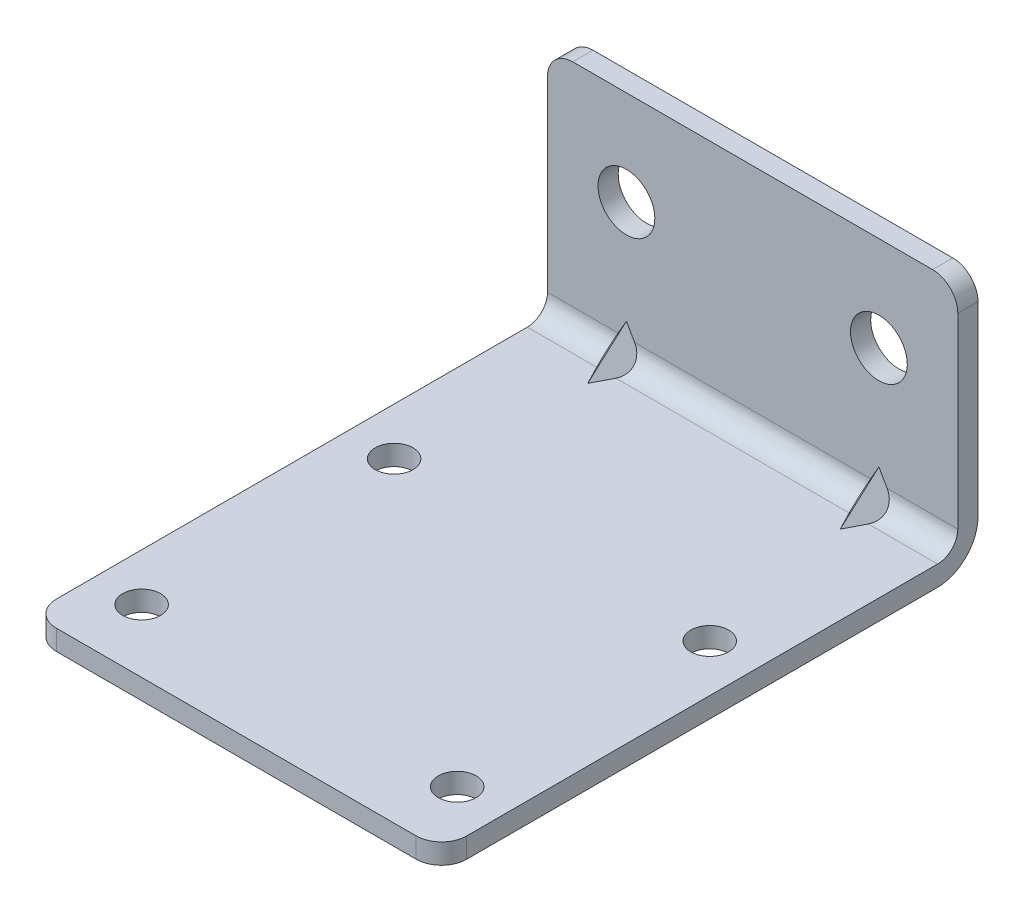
ISO-10303-21;
HEADER;
FILE_DESCRIPTION(('STEP AP214'),'2;1');
FILE_NAME('part.step','',(''),(''),'','','');
FILE_SCHEMA(('AUTOMOTIVE_DESIGN { 1 0 10303 214 1 1 1 1 }'));
ENDSEC;
DATA;
#1=APPLICATION_CONTEXT('core data for automotive mechanical design processes');
#2=APPLICATION_PROTOCOL_DEFINITION('international standard','automotive_design',2000,#1);
#3=PRODUCT_CONTEXT('',#1,'mechanical');
#4=PRODUCT('Part','Part','',(#3));
#5=PRODUCT_RELATED_PRODUCT_CATEGORY('part','',(#4));
#6=PRODUCT_DEFINITION_FORMATION('','',#4);
#7=PRODUCT_DEFINITION_CONTEXT('part definition',#1,'design');
#8=PRODUCT_DEFINITION('design','',#6,#7);
#9=PRODUCT_DEFINITION_SHAPE('','',#8);
#10=(LENGTH_UNIT() NAMED_UNIT(*) SI_UNIT(.MILLI.,.METRE.));
#11=(NAMED_UNIT(*) PLANE_ANGLE_UNIT() SI_UNIT($,.RADIAN.));
#12=(NAMED_UNIT(*) SI_UNIT($,.STERADIAN.) SOLID_ANGLE_UNIT());
#13=UNCERTAINTY_MEASURE_WITH_UNIT(LENGTH_MEASURE(1.E-05),#10,'distance_accuracy_value','');
#14=(GEOMETRIC_REPRESENTATION_CONTEXT(3) GLOBAL_UNCERTAINTY_ASSIGNED_CONTEXT((#13)) GLOBAL_UNIT_ASSIGNED_CONTEXT((#10,
#11,#12)) REPRESENTATION_CONTEXT('',''));
#15=CARTESIAN_POINT('',(0.,0.,0.));
#16=DIRECTION('',(0.,0.,1.));
#17=DIRECTION('',(1.,0.,0.));
#18=AXIS2_PLACEMENT_3D('',#15,#16,#17);
#19=CARTESIAN_POINT('',(-12.5,-25.,85.));
#20=DIRECTION('',(0.,-1.,0.));
#21=DIRECTION('',(0.,0.,1.));
#22=AXIS2_PLACEMENT_3D('',#19,#20,#21);
#23=PLANE('',#22);
#24=CARTESIAN_POINT('',(45.,-25.,35.));
#25=DIRECTION('',(0.,-1.,0.));
#26=DIRECTION('',(1.,0.,0.));
#27=AXIS2_PLACEMENT_3D('',#24,#25,#26);
#28=CIRCLE('',#27,3.);
#29=CARTESIAN_POINT('',(48.,-25.,35.));
#30=VERTEX_POINT('',#29);
#31=EDGE_CURVE('E213',#30,#30,#28,.T.);
#32=ORIENTED_EDGE('',*,*,#31,.F.);
#33=EDGE_LOOP('',(#32));
#34=FACE_BOUND('',#33,.T.);
#35=CARTESIAN_POINT('',(-5.,-25.,35.));
#36=DIRECTION('',(0.,1.,0.));
#37=DIRECTION('',(-1.,0.,0.));
#38=AXIS2_PLACEMENT_3D('',#35,#36,#37);
#39=CIRCLE('',#38,3.);
#40=CARTESIAN_POINT('',(-8.,-25.,35.));
#41=VERTEX_POINT('',#40);
#42=EDGE_CURVE('E219',#41,#41,#39,.T.);
#43=ORIENTED_EDGE('',*,*,#42,.T.);
#44=EDGE_LOOP('',(#43));
#45=FACE_BOUND('',#44,.T.);
#46=CARTESIAN_POINT('',(-5.,-25.,75.));
#47=DIRECTION('',(0.,1.,0.));
#48=DIRECTION('',(-1.,0.,0.));
#49=AXIS2_PLACEMENT_3D('',#46,#47,#48);
#50=CIRCLE('',#49,3.);
#51=CARTESIAN_POINT('',(-8.,-25.,75.));
#52=VERTEX_POINT('',#51);
#53=EDGE_CURVE('E225',#52,#52,#50,.T.);
#54=ORIENTED_EDGE('',*,*,#53,.T.);
#55=EDGE_LOOP('',(#54));
#56=FACE_BOUND('',#55,.T.);
#57=CARTESIAN_POINT('',(45.,-25.,75.));
#58=DIRECTION('',(0.,-1.,0.));
#59=DIRECTION('',(1.,0.,0.));
#60=AXIS2_PLACEMENT_3D('',#57,#58,#59);
#61=CIRCLE('',#60,3.);
#62=CARTESIAN_POINT('',(48.,-25.,75.));
#63=VERTEX_POINT('',#62);
#64=EDGE_CURVE('E207',#63,#63,#61,.T.);
#65=ORIENTED_EDGE('',*,*,#64,.F.);
#66=EDGE_LOOP('',(#65));
#67=FACE_BOUND('',#66,.T.);
#68=DIRECTION('',(0.,0.,-1.));
#69=VECTOR('',#68,1.);
#70=CARTESIAN_POINT('',(-12.5,-25.,85.));
#71=LINE('',#70,#69);
#72=CARTESIAN_POINT('',(-12.5,-25.,81.));
#73=VERTEX_POINT('',#72);
#74=CARTESIAN_POINT('',(-12.5,-25.,6.5));
#75=VERTEX_POINT('',#74);
#76=EDGE_CURVE('E251',#73,#75,#71,.T.);
#77=ORIENTED_EDGE('',*,*,#76,.T.);
#78=DIRECTION('',(1.,0.,0.));
#79=VECTOR('',#78,1.);
#80=CARTESIAN_POINT('',(-12.5,-25.,6.5));
#81=LINE('',#80,#79);
#82=CARTESIAN_POINT('',(52.5,-25.,6.5));
#83=VERTEX_POINT('',#82);
#84=EDGE_CURVE('E335',#75,#83,#81,.T.);
#85=ORIENTED_EDGE('',*,*,#84,.T.);
#86=DIRECTION('',(0.,0.,-1.));
#87=VECTOR('',#86,1.);
#88=CARTESIAN_POINT('',(52.5,-25.,85.));
#89=LINE('',#88,#87);
#90=CARTESIAN_POINT('',(52.5,-25.,81.));
#91=VERTEX_POINT('',#90);
#92=EDGE_CURVE('E242',#91,#83,#89,.T.);
#93=ORIENTED_EDGE('',*,*,#92,.F.);
#94=CARTESIAN_POINT('',(48.5,-25.,81.));
#95=DIRECTION('',(0.,-1.,0.));
#96=DIRECTION('',(0.,0.,1.));
#97=AXIS2_PLACEMENT_3D('',#94,#95,#96);
#98=CIRCLE('',#97,4.);
#99=CARTESIAN_POINT('',(48.5,-25.,85.));
#100=VERTEX_POINT('',#99);
#101=EDGE_CURVE('E297',#91,#100,#98,.T.);
#102=ORIENTED_EDGE('',*,*,#101,.T.);
#103=DIRECTION('',(1.,0.,0.));
#104=VECTOR('',#103,1.);
#105=CARTESIAN_POINT('',(-12.5,-25.,85.));
#106=LINE('',#105,#104);
#107=CARTESIAN_POINT('',(-8.5,-25.,85.));
#108=VERTEX_POINT('',#107);
#109=EDGE_CURVE('E265',#108,#100,#106,.T.);
#110=ORIENTED_EDGE('',*,*,#109,.F.);
#111=CARTESIAN_POINT('',(-8.5,-25.,81.));
#112=DIRECTION('',(0.,-1.,0.));
#113=DIRECTION('',(0.,0.,1.));
#114=AXIS2_PLACEMENT_3D('',#111,#112,#113);
#115=CIRCLE('',#114,4.);
#116=EDGE_CURVE('E299',#108,#73,#115,.T.);
#117=ORIENTED_EDGE('',*,*,#116,.T.);
#118=EDGE_LOOP('',(#77,#85,#93,#102,#110,#117));
#119=FACE_BOUND('',#118,.T.);
#120=ADVANCED_FACE('F14',(#34,#45,#56,#67,#119),#23,.T.);
#121=CARTESIAN_POINT('',(-12.5,-25.,0.));
#122=DIRECTION('',(0.,0.,-1.));
#123=DIRECTION('',(0.,-1.,0.));
#124=AXIS2_PLACEMENT_3D('',#121,#122,#123);
#125=PLANE('',#124);
#126=CARTESIAN_POINT('',(40.,0.,0.));
#127=DIRECTION('',(0.,0.,1.));
#128=DIRECTION('',(0.,1.,0.));
#129=AXIS2_PLACEMENT_3D('',#126,#127,#128);
#130=CIRCLE('',#129,4.5);
#131=CARTESIAN_POINT('',(40.,4.5,0.));
#132=VERTEX_POINT('',#131);
#133=EDGE_CURVE('E237',#132,#132,#130,.T.);
#134=ORIENTED_EDGE('',*,*,#133,.T.);
#135=EDGE_LOOP('',(#134));
#136=FACE_BOUND('',#135,.T.);
#137=CARTESIAN_POINT('',(0.,0.,0.));
#138=DIRECTION('',(0.,0.,-1.));
#139=DIRECTION('',(0.,-1.,0.));
#140=AXIS2_PLACEMENT_3D('',#137,#138,#139);
#141=CIRCLE('',#140,4.5);
#142=CARTESIAN_POINT('',(0.,-4.5,0.));
#143=VERTEX_POINT('',#142);
#144=EDGE_CURVE('E231',#143,#143,#141,.T.);
#145=ORIENTED_EDGE('',*,*,#144,.F.);
#146=EDGE_LOOP('',(#145));
#147=FACE_BOUND('',#146,.T.);
#148=DIRECTION('',(0.,1.,0.));
#149=VECTOR('',#148,1.);
#150=CARTESIAN_POINT('',(52.5,-25.,0.));
#151=LINE('',#150,#149);
#152=CARTESIAN_POINT('',(52.5,-18.5,0.));
#153=VERTEX_POINT('',#152);
#154=CARTESIAN_POINT('',(52.5,11.,0.));
#155=VERTEX_POINT('',#154);
#156=EDGE_CURVE('E240',#153,#155,#151,.T.);
#157=ORIENTED_EDGE('',*,*,#156,.F.);
#158=DIRECTION('',(1.,0.,0.));
#159=VECTOR('',#158,1.);
#160=CARTESIAN_POINT('',(49.0494487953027,-18.5,0.));
#161=LINE('',#160,#159);
#162=CARTESIAN_POINT('',(45.5988975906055,-18.5,0.));
#163=VERTEX_POINT('',#162);
#164=EDGE_CURVE('E344',#153,#163,#161,.F.);
#165=ORIENTED_EDGE('',*,*,#164,.T.);
#166=DIRECTION('',(0.267158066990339,-0.963652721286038,0.));
#167=VECTOR('',#166,1.);
#168=CARTESIAN_POINT('',(45.,-16.3397459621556,0.));
#169=LINE('',#168,#167);
#170=CARTESIAN_POINT('',(45.,-16.3397459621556,0.));
#171=VERTEX_POINT('',#170);
#172=EDGE_CURVE('E404',#171,#163,#169,.T.);
#173=ORIENTED_EDGE('',*,*,#172,.F.);
#174=DIRECTION('',(-0.5,-0.866025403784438,0.));
#175=VECTOR('',#174,1.);
#176=CARTESIAN_POINT('',(45.,-16.3397459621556,0.));
#177=LINE('',#176,#175);
#178=CARTESIAN_POINT('',(43.7527767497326,-18.5,0.));
#179=VERTEX_POINT('',#178);
#180=EDGE_CURVE('E406',#171,#179,#177,.T.);
#181=ORIENTED_EDGE('',*,*,#180,.T.);
#182=DIRECTION('',(1.,0.,0.));
#183=VECTOR('',#182,1.);
#184=CARTESIAN_POINT('',(-12.5,-18.5,0.));
#185=LINE('',#184,#183);
#186=CARTESIAN_POINT('',(-3.75277674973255,-18.5,0.));
#187=VERTEX_POINT('',#186);
#188=EDGE_CURVE('E342',#179,#187,#185,.F.);
#189=ORIENTED_EDGE('',*,*,#188,.T.);
#190=DIRECTION('',(0.5,-0.866025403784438,0.));
#191=VECTOR('',#190,1.);
#192=CARTESIAN_POINT('',(-5.,-16.3397459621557,0.));
#193=LINE('',#192,#191);
#194=CARTESIAN_POINT('',(-5.,-16.3397459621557,0.));
#195=VERTEX_POINT('',#194);
#196=EDGE_CURVE('E362',#195,#187,#193,.T.);
#197=ORIENTED_EDGE('',*,*,#196,.F.);
#198=DIRECTION('',(-0.267158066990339,-0.963652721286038,0.));
#199=VECTOR('',#198,1.);
#200=CARTESIAN_POINT('',(-5.,-16.3397459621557,0.));
#201=LINE('',#200,#199);
#202=CARTESIAN_POINT('',(-5.59889759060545,-18.5,0.));
#203=VERTEX_POINT('',#202);
#204=EDGE_CURVE('E354',#195,#203,#201,.T.);
#205=ORIENTED_EDGE('',*,*,#204,.T.);
#206=DIRECTION('',(1.,0.,0.));
#207=VECTOR('',#206,1.);
#208=CARTESIAN_POINT('',(-9.0494487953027,-18.5,0.));
#209=LINE('',#208,#207);
#210=CARTESIAN_POINT('',(-12.5,-18.5,0.));
#211=VERTEX_POINT('',#210);
#212=EDGE_CURVE('E340',#203,#211,#209,.F.);
#213=ORIENTED_EDGE('',*,*,#212,.T.);
#214=DIRECTION('',(0.,1.,0.));
#215=VECTOR('',#214,1.);
#216=CARTESIAN_POINT('',(-12.5,-25.,0.));
#217=LINE('',#216,#215);
#218=CARTESIAN_POINT('',(-12.5,11.,0.));
#219=VERTEX_POINT('',#218);
#220=EDGE_CURVE('E249',#211,#219,#217,.T.);
#221=ORIENTED_EDGE('',*,*,#220,.T.);
#222=CARTESIAN_POINT('',(-8.5,11.,0.));
#223=DIRECTION('',(0.,0.,-1.));
#224=DIRECTION('',(0.,-1.,0.));
#225=AXIS2_PLACEMENT_3D('',#222,#223,#224);
#226=CIRCLE('',#225,4.);
#227=CARTESIAN_POINT('',(-8.5,15.,0.));
#228=VERTEX_POINT('',#227);
#229=EDGE_CURVE('E276',#219,#228,#226,.T.);
#230=ORIENTED_EDGE('',*,*,#229,.T.);
#231=DIRECTION('',(1.,0.,0.));
#232=VECTOR('',#231,1.);
#233=CARTESIAN_POINT('',(-12.5,15.,0.));
#234=LINE('',#233,#232);
#235=CARTESIAN_POINT('',(48.5,15.,0.));
#236=VERTEX_POINT('',#235);
#237=EDGE_CURVE('E268',#228,#236,#234,.T.);
#238=ORIENTED_EDGE('',*,*,#237,.T.);
#239=CARTESIAN_POINT('',(48.5,11.,0.));
#240=DIRECTION('',(0.,0.,-1.));
#241=DIRECTION('',(0.,-1.,0.));
#242=AXIS2_PLACEMENT_3D('',#239,#240,#241);
#243=CIRCLE('',#242,4.);
#244=EDGE_CURVE('E278',#236,#155,#243,.T.);
#245=ORIENTED_EDGE('',*,*,#244,.T.);
#246=EDGE_LOOP('',(#157,#165,#173,#181,#189,#197,#205,#213,#221,#230,#238,#245));
#247=FACE_BOUND('',#246,.T.);
#248=ADVANCED_FACE('F16',(#136,#147,#247),#125,.T.);
#249=CARTESIAN_POINT('',(-12.5,-21.8,85.));
#250=DIRECTION('',(0.,-1.,0.));
#251=DIRECTION('',(0.,0.,1.));
#252=AXIS2_PLACEMENT_3D('',#249,#250,#251);
#253=PLANE('',#252);
#254=CARTESIAN_POINT('',(45.,-21.8,75.));
#255=DIRECTION('',(0.,-1.,0.));
#256=DIRECTION('',(1.,0.,0.));
#257=AXIS2_PLACEMENT_3D('',#254,#255,#256);
#258=CIRCLE('',#257,3.);
#259=CARTESIAN_POINT('',(48.,-21.8,75.));
#260=VERTEX_POINT('',#259);
#261=EDGE_CURVE('E204',#260,#260,#258,.T.);
#262=ORIENTED_EDGE('',*,*,#261,.T.);
#263=EDGE_LOOP('',(#262));
#264=FACE_BOUND('',#263,.T.);
#265=CARTESIAN_POINT('',(-5.,-21.8,75.));
#266=DIRECTION('',(0.,1.,0.));
#267=DIRECTION('',(-1.,0.,0.));
#268=AXIS2_PLACEMENT_3D('',#265,#266,#267);
#269=CIRCLE('',#268,3.);
#270=CARTESIAN_POINT('',(-8.,-21.8,75.));
#271=VERTEX_POINT('',#270);
#272=EDGE_CURVE('E222',#271,#271,#269,.T.);
#273=ORIENTED_EDGE('',*,*,#272,.F.);
#274=EDGE_LOOP('',(#273));
#275=FACE_BOUND('',#274,.T.);
#276=CARTESIAN_POINT('',(-5.,-21.8,35.));
#277=DIRECTION('',(0.,1.,0.));
#278=DIRECTION('',(-1.,0.,0.));
#279=AXIS2_PLACEMENT_3D('',#276,#277,#278);
#280=CIRCLE('',#279,3.);
#281=CARTESIAN_POINT('',(-8.,-21.8,35.));
#282=VERTEX_POINT('',#281);
#283=EDGE_CURVE('E216',#282,#282,#280,.T.);
#284=ORIENTED_EDGE('',*,*,#283,.F.);
#285=EDGE_LOOP('',(#284));
#286=FACE_BOUND('',#285,.T.);
#287=CARTESIAN_POINT('',(45.,-21.8,35.));
#288=DIRECTION('',(0.,-1.,0.));
#289=DIRECTION('',(1.,0.,0.));
#290=AXIS2_PLACEMENT_3D('',#287,#288,#289);
#291=CIRCLE('',#290,3.);
#292=CARTESIAN_POINT('',(48.,-21.8,35.));
#293=VERTEX_POINT('',#292);
#294=EDGE_CURVE('E210',#293,#293,#291,.T.);
#295=ORIENTED_EDGE('',*,*,#294,.T.);
#296=EDGE_LOOP('',(#295));
#297=FACE_BOUND('',#296,.T.);
#298=DIRECTION('',(-0.457221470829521,0.,-0.889352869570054));
#299=VECTOR('',#298,1.);
#300=CARTESIAN_POINT('',(28.1558422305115,-21.8,64.0985955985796));
#301=LINE('',#300,#299);
#302=CARTESIAN_POINT('',(0.,-21.8,9.33196568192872));
#303=VERTEX_POINT('',#302);
#304=CARTESIAN_POINT('',(-1.5073405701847,-21.8,6.4));
#305=VERTEX_POINT('',#304);
#306=EDGE_CURVE('E202',#303,#305,#301,.T.);
#307=ORIENTED_EDGE('',*,*,#306,.T.);
#308=DIRECTION('',(1.,0.,0.));
#309=VECTOR('',#308,1.);
#310=CARTESIAN_POINT('',(-12.5,-21.8,6.4));
#311=LINE('',#310,#309);
#312=CARTESIAN_POINT('',(-12.5,-21.8,6.4));
#313=VERTEX_POINT('',#312);
#314=EDGE_CURVE('E324',#305,#313,#311,.F.);
#315=ORIENTED_EDGE('',*,*,#314,.T.);
#316=DIRECTION('',(0.,0.,-1.));
#317=VECTOR('',#316,1.);
#318=CARTESIAN_POINT('',(-12.5,-21.8,85.));
#319=LINE('',#318,#317);
#320=CARTESIAN_POINT('',(-12.5,-21.8,81.));
#321=VERTEX_POINT('',#320);
#322=EDGE_CURVE('E254',#321,#313,#319,.T.);
#323=ORIENTED_EDGE('',*,*,#322,.F.);
#324=CARTESIAN_POINT('',(-8.5,-21.8,81.));
#325=DIRECTION('',(0.,-1.,0.));
#326=DIRECTION('',(0.,0.,1.));
#327=AXIS2_PLACEMENT_3D('',#324,#325,#326);
#328=CIRCLE('',#327,4.);
#329=CARTESIAN_POINT('',(-8.5,-21.8,85.));
#330=VERTEX_POINT('',#329);
#331=EDGE_CURVE('E305',#321,#330,#328,.F.);
#332=ORIENTED_EDGE('',*,*,#331,.T.);
#333=DIRECTION('',(1.,0.,0.));
#334=VECTOR('',#333,1.);
#335=CARTESIAN_POINT('',(-12.5,-21.8,85.));
#336=LINE('',#335,#334);
#337=CARTESIAN_POINT('',(48.5,-21.8,85.));
#338=VERTEX_POINT('',#337);
#339=EDGE_CURVE('E262',#330,#338,#336,.T.);
#340=ORIENTED_EDGE('',*,*,#339,.T.);
#341=CARTESIAN_POINT('',(48.5,-21.8,81.));
#342=DIRECTION('',(0.,-1.,0.));
#343=DIRECTION('',(0.,0.,1.));
#344=AXIS2_PLACEMENT_3D('',#341,#342,#343);
#345=CIRCLE('',#344,4.);
#346=CARTESIAN_POINT('',(52.5,-21.8,81.));
#347=VERTEX_POINT('',#346);
#348=EDGE_CURVE('E303',#338,#347,#345,.F.);
#349=ORIENTED_EDGE('',*,*,#348,.T.);
#350=DIRECTION('',(0.,0.,-1.));
#351=VECTOR('',#350,1.);
#352=CARTESIAN_POINT('',(52.5,-21.8,85.));
#353=LINE('',#352,#351);
#354=CARTESIAN_POINT('',(52.5,-21.8,6.4));
#355=VERTEX_POINT('',#354);
#356=EDGE_CURVE('E245',#347,#355,#353,.T.);
#357=ORIENTED_EDGE('',*,*,#356,.T.);
#358=DIRECTION('',(1.,0.,0.));
#359=VECTOR('',#358,1.);
#360=CARTESIAN_POINT('',(-12.5,-21.8,6.4));
#361=LINE('',#360,#359);
#362=CARTESIAN_POINT('',(41.5073405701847,-21.8,6.4));
#363=VERTEX_POINT('',#362);
#364=EDGE_CURVE('E188',#355,#363,#361,.F.);
#365=ORIENTED_EDGE('',*,*,#364,.T.);
#366=DIRECTION('',(-0.457221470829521,0.,0.889352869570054));
#367=VECTOR('',#366,1.);
#368=CARTESIAN_POINT('',(-1.7441880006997,-21.8,90.5296253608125));
#369=LINE('',#368,#367);
#370=CARTESIAN_POINT('',(40.,-21.8,9.3319656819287));
#371=VERTEX_POINT('',#370);
#372=EDGE_CURVE('E173',#371,#363,#369,.F.);
#373=ORIENTED_EDGE('',*,*,#372,.F.);
#374=DIRECTION('',(-0.457221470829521,0.,-0.889352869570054));
#375=VECTOR('',#374,1.);
#376=CARTESIAN_POINT('',(59.7937832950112,-21.8,47.8333465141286));
#377=LINE('',#376,#375);
#378=CARTESIAN_POINT('',(38.4926594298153,-21.8,6.4));
#379=VERTEX_POINT('',#378);
#380=EDGE_CURVE('E164',#371,#379,#377,.T.);
#381=ORIENTED_EDGE('',*,*,#380,.T.);
#382=DIRECTION('',(1.,0.,0.));
#383=VECTOR('',#382,1.);
#384=CARTESIAN_POINT('',(-12.5,-21.8,6.4));
#385=LINE('',#384,#383);
#386=CARTESIAN_POINT('',(1.5073405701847,-21.8,6.4));
#387=VERTEX_POINT('',#386);
#388=EDGE_CURVE('E321',#379,#387,#385,.F.);
#389=ORIENTED_EDGE('',*,*,#388,.T.);
#390=DIRECTION('',(-0.457221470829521,0.,0.889352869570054));
#391=VECTOR('',#390,1.);
#392=CARTESIAN_POINT('',(-33.3821290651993,-21.8,74.2643762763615));
#393=LINE('',#392,#391);
#394=EDGE_CURVE('E199',#303,#387,#393,.F.);
#395=ORIENTED_EDGE('',*,*,#394,.F.);
#396=EDGE_LOOP('',(#307,#315,#323,#332,#340,#349,#357,#365,#373,#381,#389,#395));
#397=FACE_BOUND('',#396,.T.);
#398=ADVANCED_FACE('F185',(#264,#275,#286,#297,#397),#253,.F.);
#399=CARTESIAN_POINT('',(-12.5,-25.,3.2));
#400=DIRECTION('',(0.,0.,-1.));
#401=DIRECTION('',(0.,-1.,0.));
#402=AXIS2_PLACEMENT_3D('',#399,#400,#401);
#403=PLANE('',#402);
#404=CARTESIAN_POINT('',(0.,0.,3.2));
#405=DIRECTION('',(0.,0.,-1.));
#406=DIRECTION('',(0.,-1.,0.));
#407=AXIS2_PLACEMENT_3D('',#404,#405,#406);
#408=CIRCLE('',#407,4.5);
#409=CARTESIAN_POINT('',(0.,-4.5,3.2));
#410=VERTEX_POINT('',#409);
#411=EDGE_CURVE('E228',#410,#410,#408,.T.);
#412=ORIENTED_EDGE('',*,*,#411,.T.);
#413=EDGE_LOOP('',(#412));
#414=FACE_BOUND('',#413,.T.);
#415=CARTESIAN_POINT('',(40.,0.,3.2));
#416=DIRECTION('',(0.,0.,1.));
#417=DIRECTION('',(0.,1.,0.));
#418=AXIS2_PLACEMENT_3D('',#415,#416,#417);
#419=CIRCLE('',#418,4.5);
#420=CARTESIAN_POINT('',(40.,4.5,3.2));
#421=VERTEX_POINT('',#420);
#422=EDGE_CURVE('E234',#421,#421,#419,.T.);
#423=ORIENTED_EDGE('',*,*,#422,.F.);
#424=EDGE_LOOP('',(#423));
#425=FACE_BOUND('',#424,.T.);
#426=DIRECTION('',(0.,1.,0.));
#427=VECTOR('',#426,1.);
#428=CARTESIAN_POINT('',(-12.5,-25.,3.2));
#429=LINE('',#428,#427);
#430=CARTESIAN_POINT('',(-12.5,-18.6,3.2));
#431=VERTEX_POINT('',#430);
#432=CARTESIAN_POINT('',(-12.5,11.,3.2));
#433=VERTEX_POINT('',#432);
#434=EDGE_CURVE('E257',#431,#433,#429,.T.);
#435=ORIENTED_EDGE('',*,*,#434,.F.);
#436=DIRECTION('',(1.,0.,0.));
#437=VECTOR('',#436,1.);
#438=CARTESIAN_POINT('',(-12.5,-18.6,3.2));
#439=LINE('',#438,#437);
#440=CARTESIAN_POINT('',(-1.3049582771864,-18.6,3.2));
#441=VERTEX_POINT('',#440);
#442=EDGE_CURVE('E316',#431,#441,#439,.T.);
#443=ORIENTED_EDGE('',*,*,#442,.T.);
#444=DIRECTION('',(0.5,0.866025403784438,0.));
#445=VECTOR('',#444,1.);
#446=CARTESIAN_POINT('',(-5.,-25.,3.2));
#447=LINE('',#446,#445);
#448=CARTESIAN_POINT('',(0.,-16.3397459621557,3.2));
#449=VERTEX_POINT('',#448);
#450=EDGE_CURVE('E189',#441,#449,#447,.T.);
#451=ORIENTED_EDGE('',*,*,#450,.T.);
#452=DIRECTION('',(-0.5,0.866025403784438,0.));
#453=VECTOR('',#452,1.);
#454=CARTESIAN_POINT('',(5.,-25.,3.2));
#455=LINE('',#454,#453);
#456=CARTESIAN_POINT('',(1.3049582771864,-18.6,3.2));
#457=VERTEX_POINT('',#456);
#458=EDGE_CURVE('E192',#457,#449,#455,.T.);
#459=ORIENTED_EDGE('',*,*,#458,.F.);
#460=DIRECTION('',(1.,0.,0.));
#461=VECTOR('',#460,1.);
#462=CARTESIAN_POINT('',(-12.5,-18.6,3.2));
#463=LINE('',#462,#461);
#464=CARTESIAN_POINT('',(38.6950417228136,-18.6,3.2));
#465=VERTEX_POINT('',#464);
#466=EDGE_CURVE('E310',#457,#465,#463,.T.);
#467=ORIENTED_EDGE('',*,*,#466,.T.);
#468=DIRECTION('',(0.5,0.866025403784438,0.));
#469=VECTOR('',#468,1.);
#470=CARTESIAN_POINT('',(35.,-25.,3.2));
#471=LINE('',#470,#469);
#472=CARTESIAN_POINT('',(40.,-16.3397459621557,3.2));
#473=VERTEX_POINT('',#472);
#474=EDGE_CURVE('E182',#465,#473,#471,.T.);
#475=ORIENTED_EDGE('',*,*,#474,.T.);
#476=DIRECTION('',(-0.5,0.866025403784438,0.));
#477=VECTOR('',#476,1.);
#478=CARTESIAN_POINT('',(45.,-25.,3.2));
#479=LINE('',#478,#477);
#480=CARTESIAN_POINT('',(41.3049582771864,-18.6,3.2));
#481=VERTEX_POINT('',#480);
#482=EDGE_CURVE('E181',#481,#473,#479,.T.);
#483=ORIENTED_EDGE('',*,*,#482,.F.);
#484=DIRECTION('',(1.,0.,0.));
#485=VECTOR('',#484,1.);
#486=CARTESIAN_POINT('',(-12.5,-18.6,3.2));
#487=LINE('',#486,#485);
#488=CARTESIAN_POINT('',(52.5,-18.6,3.2));
#489=VERTEX_POINT('',#488);
#490=EDGE_CURVE('E313',#481,#489,#487,.T.);
#491=ORIENTED_EDGE('',*,*,#490,.T.);
#492=DIRECTION('',(0.,1.,0.));
#493=VECTOR('',#492,1.);
#494=CARTESIAN_POINT('',(52.5,-25.,3.2));
#495=LINE('',#494,#493);
#496=CARTESIAN_POINT('',(52.5,11.,3.2));
#497=VERTEX_POINT('',#496);
#498=EDGE_CURVE('E247',#489,#497,#495,.T.);
#499=ORIENTED_EDGE('',*,*,#498,.T.);
#500=CARTESIAN_POINT('',(48.5,11.,3.2));
#501=DIRECTION('',(0.,0.,-1.));
#502=DIRECTION('',(0.,-1.,0.));
#503=AXIS2_PLACEMENT_3D('',#500,#501,#502);
#504=CIRCLE('',#503,4.);
#505=CARTESIAN_POINT('',(48.5,15.,3.2));
#506=VERTEX_POINT('',#505);
#507=EDGE_CURVE('E287',#497,#506,#504,.F.);
#508=ORIENTED_EDGE('',*,*,#507,.T.);
#509=DIRECTION('',(1.,0.,0.));
#510=VECTOR('',#509,1.);
#511=CARTESIAN_POINT('',(-12.5,15.,3.2));
#512=LINE('',#511,#510);
#513=CARTESIAN_POINT('',(-8.5,15.,3.2));
#514=VERTEX_POINT('',#513);
#515=EDGE_CURVE('E259',#514,#506,#512,.T.);
#516=ORIENTED_EDGE('',*,*,#515,.F.);
#517=CARTESIAN_POINT('',(-8.5,11.,3.2));
#518=DIRECTION('',(0.,0.,-1.));
#519=DIRECTION('',(0.,-1.,0.));
#520=AXIS2_PLACEMENT_3D('',#517,#518,#519);
#521=CIRCLE('',#520,4.);
#522=EDGE_CURVE('E284',#514,#433,#521,.F.);
#523=ORIENTED_EDGE('',*,*,#522,.T.);
#524=EDGE_LOOP('',(#435,#443,#451,#459,#467,#475,#483,#491,#499,#508,#516,#523));
#525=FACE_BOUND('',#524,.T.);
#526=ADVANCED_FACE('F397',(#414,#425,#525),#403,.F.);
#527=CARTESIAN_POINT('',(-12.5,15.,3.2));
#528=DIRECTION('',(0.,-1.,0.));
#529=DIRECTION('',(1.,0.,0.));
#530=AXIS2_PLACEMENT_3D('',#527,#528,#529);
#531=PLANE('',#530);
#532=ORIENTED_EDGE('',*,*,#515,.T.);
#533=DIRECTION('',(0.,0.,-1.));
#534=VECTOR('',#533,1.);
#535=CARTESIAN_POINT('',(48.5,15.,3.2));
#536=LINE('',#535,#534);
#537=EDGE_CURVE('E273',#506,#236,#536,.T.);
#538=ORIENTED_EDGE('',*,*,#537,.T.);
#539=ORIENTED_EDGE('',*,*,#237,.F.);
#540=DIRECTION('',(0.,0.,-1.));
#541=VECTOR('',#540,1.);
#542=CARTESIAN_POINT('',(-8.5,15.,85.));
#543=LINE('',#542,#541);
#544=EDGE_CURVE('E271',#228,#514,#543,.F.);
#545=ORIENTED_EDGE('',*,*,#544,.T.);
#546=EDGE_LOOP('',(#532,#538,#539,#545));
#547=FACE_BOUND('',#546,.T.);
#548=ADVANCED_FACE('F438',(#547),#531,.F.);
#549=CARTESIAN_POINT('',(-12.5,-21.8,85.));
#550=DIRECTION('',(0.,0.,1.));
#551=DIRECTION('',(0.,1.,0.));
#552=AXIS2_PLACEMENT_3D('',#549,#550,#551);
#553=PLANE('',#552);
#554=ORIENTED_EDGE('',*,*,#339,.F.);
#555=DIRECTION('',(0.,-1.,0.));
#556=VECTOR('',#555,1.);
#557=CARTESIAN_POINT('',(-8.5,-21.8,85.));
#558=LINE('',#557,#556);
#559=EDGE_CURVE('E294',#330,#108,#558,.T.);
#560=ORIENTED_EDGE('',*,*,#559,.T.);
#561=ORIENTED_EDGE('',*,*,#109,.T.);
#562=DIRECTION('',(0.,-1.,0.));
#563=VECTOR('',#562,1.);
#564=CARTESIAN_POINT('',(48.5,15.,85.));
#565=LINE('',#564,#563);
#566=EDGE_CURVE('E292',#100,#338,#565,.F.);
#567=ORIENTED_EDGE('',*,*,#566,.T.);
#568=EDGE_LOOP('',(#554,#560,#561,#567));
#569=FACE_BOUND('',#568,.T.);
#570=ADVANCED_FACE('F381',(#569),#553,.T.);
#571=CARTESIAN_POINT('',(-12.5,15.,85.));
#572=DIRECTION('',(-1.,0.,0.));
#573=DIRECTION('',(0.,-1.,0.));
#574=AXIS2_PLACEMENT_3D('',#571,#572,#573);
#575=PLANE('',#574);
#576=ORIENTED_EDGE('',*,*,#220,.F.);
#577=CARTESIAN_POINT('',(-12.5,-18.5,6.5));
#578=DIRECTION('',(-1.,0.,0.));
#579=DIRECTION('',(0.,-1.,0.));
#580=AXIS2_PLACEMENT_3D('',#577,#578,#579);
#581=CIRCLE('',#580,6.5);
#582=EDGE_CURVE('E9',#211,#75,#581,.T.);
#583=ORIENTED_EDGE('',*,*,#582,.T.);
#584=ORIENTED_EDGE('',*,*,#76,.F.);
#585=DIRECTION('',(0.,-1.,0.));
#586=VECTOR('',#585,1.);
#587=CARTESIAN_POINT('',(-12.5,15.,81.));
#588=LINE('',#587,#586);
#589=EDGE_CURVE('E301',#73,#321,#588,.F.);
#590=ORIENTED_EDGE('',*,*,#589,.T.);
#591=ORIENTED_EDGE('',*,*,#322,.T.);
#592=CARTESIAN_POINT('',(-12.5,-18.6,6.4));
#593=DIRECTION('',(-1.,0.,0.));
#594=DIRECTION('',(0.,-1.,0.));
#595=AXIS2_PLACEMENT_3D('',#592,#593,#594);
#596=CIRCLE('',#595,3.2);
#597=EDGE_CURVE('E331',#313,#431,#596,.F.);
#598=ORIENTED_EDGE('',*,*,#597,.T.);
#599=ORIENTED_EDGE('',*,*,#434,.T.);
#600=DIRECTION('',(0.,0.,-1.));
#601=VECTOR('',#600,1.);
#602=CARTESIAN_POINT('',(-12.5,11.,85.));
#603=LINE('',#602,#601);
#604=EDGE_CURVE('E289',#433,#219,#603,.T.);
#605=ORIENTED_EDGE('',*,*,#604,.T.);
#606=EDGE_LOOP('',(#576,#583,#584,#590,#591,#598,#599,#605));
#607=FACE_BOUND('',#606,.T.);
#608=ADVANCED_FACE('F370',(#607),#575,.T.);
#609=CARTESIAN_POINT('',(52.5,15.,85.));
#610=DIRECTION('',(-1.,0.,0.));
#611=DIRECTION('',(0.,-1.,0.));
#612=AXIS2_PLACEMENT_3D('',#609,#610,#611);
#613=PLANE('',#612);
#614=ORIENTED_EDGE('',*,*,#92,.T.);
#615=CARTESIAN_POINT('',(52.5,-18.5,6.5));
#616=DIRECTION('',(-1.,0.,0.));
#617=DIRECTION('',(0.,-1.,0.));
#618=AXIS2_PLACEMENT_3D('',#615,#616,#617);
#619=CIRCLE('',#618,6.5);
#620=EDGE_CURVE('E338',#83,#153,#619,.F.);
#621=ORIENTED_EDGE('',*,*,#620,.T.);
#622=ORIENTED_EDGE('',*,*,#156,.T.);
#623=DIRECTION('',(0.,0.,-1.));
#624=VECTOR('',#623,1.);
#625=CARTESIAN_POINT('',(52.5,11.,85.));
#626=LINE('',#625,#624);
#627=EDGE_CURVE('E281',#155,#497,#626,.F.);
#628=ORIENTED_EDGE('',*,*,#627,.T.);
#629=ORIENTED_EDGE('',*,*,#498,.F.);
#630=CARTESIAN_POINT('',(52.5,-18.6,6.4));
#631=DIRECTION('',(-1.,0.,0.));
#632=DIRECTION('',(0.,-1.,0.));
#633=AXIS2_PLACEMENT_3D('',#630,#631,#632);
#634=CIRCLE('',#633,3.2);
#635=EDGE_CURVE('E333',#489,#355,#634,.T.);
#636=ORIENTED_EDGE('',*,*,#635,.T.);
#637=ORIENTED_EDGE('',*,*,#356,.F.);
#638=DIRECTION('',(0.,-1.,0.));
#639=VECTOR('',#638,1.);
#640=CARTESIAN_POINT('',(52.5,15.,81.));
#641=LINE('',#640,#639);
#642=EDGE_CURVE('E307',#347,#91,#641,.T.);
#643=ORIENTED_EDGE('',*,*,#642,.T.);
#644=EDGE_LOOP('',(#614,#621,#622,#628,#629,#636,#637,#643));
#645=FACE_BOUND('',#644,.T.);
#646=ADVANCED_FACE('F390',(#645),#613,.F.);
#647=CARTESIAN_POINT('',(48.5,11.,3.2));
#648=DIRECTION('',(0.,0.,-1.));
#649=DIRECTION('',(0.,-1.,0.));
#650=AXIS2_PLACEMENT_3D('',#647,#648,#649);
#651=CYLINDRICAL_SURFACE('',#650,4.);
#652=ORIENTED_EDGE('',*,*,#507,.F.);
#653=ORIENTED_EDGE('',*,*,#627,.F.);
#654=ORIENTED_EDGE('',*,*,#244,.F.);
#655=ORIENTED_EDGE('',*,*,#537,.F.);
#656=EDGE_LOOP('',(#652,#653,#654,#655));
#657=FACE_BOUND('',#656,.T.);
#658=ADVANCED_FACE('F452',(#657),#651,.T.);
#659=CARTESIAN_POINT('',(-8.5,11.,85.));
#660=DIRECTION('',(0.,0.,1.));
#661=DIRECTION('',(0.,1.,0.));
#662=AXIS2_PLACEMENT_3D('',#659,#660,#661);
#663=CYLINDRICAL_SURFACE('',#662,4.);
#664=ORIENTED_EDGE('',*,*,#522,.F.);
#665=ORIENTED_EDGE('',*,*,#544,.F.);
#666=ORIENTED_EDGE('',*,*,#229,.F.);
#667=ORIENTED_EDGE('',*,*,#604,.F.);
#668=EDGE_LOOP('',(#664,#665,#666,#667));
#669=FACE_BOUND('',#668,.T.);
#670=ADVANCED_FACE('F455',(#669),#663,.T.);
#671=CARTESIAN_POINT('',(-8.5,-21.8,81.));
#672=DIRECTION('',(0.,-1.,0.));
#673=DIRECTION('',(1.,0.,0.));
#674=AXIS2_PLACEMENT_3D('',#671,#672,#673);
#675=CYLINDRICAL_SURFACE('',#674,4.);
#676=ORIENTED_EDGE('',*,*,#331,.F.);
#677=ORIENTED_EDGE('',*,*,#589,.F.);
#678=ORIENTED_EDGE('',*,*,#116,.F.);
#679=ORIENTED_EDGE('',*,*,#559,.F.);
#680=EDGE_LOOP('',(#676,#677,#678,#679));
#681=FACE_BOUND('',#680,.T.);
#682=ADVANCED_FACE('F378',(#681),#675,.T.);
#683=CARTESIAN_POINT('',(48.5,15.,81.));
#684=DIRECTION('',(0.,1.,0.));
#685=DIRECTION('',(-1.,0.,0.));
#686=AXIS2_PLACEMENT_3D('',#683,#684,#685);
#687=CYLINDRICAL_SURFACE('',#686,4.);
#688=ORIENTED_EDGE('',*,*,#348,.F.);
#689=ORIENTED_EDGE('',*,*,#566,.F.);
#690=ORIENTED_EDGE('',*,*,#101,.F.);
#691=ORIENTED_EDGE('',*,*,#642,.F.);
#692=EDGE_LOOP('',(#688,#689,#690,#691));
#693=FACE_BOUND('',#692,.T.);
#694=ADVANCED_FACE('F388',(#693),#687,.T.);
#695=CARTESIAN_POINT('',(40.,0.,0.));
#696=DIRECTION('',(0.,0.,1.));
#697=DIRECTION('',(0.,1.,0.));
#698=AXIS2_PLACEMENT_3D('',#695,#696,#697);
#699=CYLINDRICAL_SURFACE('',#698,4.5);
#700=ORIENTED_EDGE('',*,*,#133,.F.);
#701=EDGE_LOOP('',(#700));
#702=FACE_BOUND('',#701,.T.);
#703=ORIENTED_EDGE('',*,*,#422,.T.);
#704=EDGE_LOOP('',(#703));
#705=FACE_BOUND('',#704,.T.);
#706=ADVANCED_FACE('F464',(#702,#705),#699,.F.);
#707=CARTESIAN_POINT('',(0.,0.,0.));
#708=DIRECTION('',(0.,0.,1.));
#709=DIRECTION('',(0.,1.,0.));
#710=AXIS2_PLACEMENT_3D('',#707,#708,#709);
#711=CYLINDRICAL_SURFACE('',#710,4.5);
#712=ORIENTED_EDGE('',*,*,#144,.T.);
#713=EDGE_LOOP('',(#712));
#714=FACE_BOUND('',#713,.T.);
#715=ORIENTED_EDGE('',*,*,#411,.F.);
#716=EDGE_LOOP('',(#715));
#717=FACE_BOUND('',#716,.T.);
#718=ADVANCED_FACE('F467',(#714,#717),#711,.F.);
#719=CARTESIAN_POINT('',(-5.,-25.,75.));
#720=DIRECTION('',(0.,1.,0.));
#721=DIRECTION('',(-1.,0.,0.));
#722=AXIS2_PLACEMENT_3D('',#719,#720,#721);
#723=CYLINDRICAL_SURFACE('',#722,3.);
#724=ORIENTED_EDGE('',*,*,#53,.F.);
#725=EDGE_LOOP('',(#724));
#726=FACE_BOUND('',#725,.T.);
#727=ORIENTED_EDGE('',*,*,#272,.T.);
#728=EDGE_LOOP('',(#727));
#729=FACE_BOUND('',#728,.T.);
#730=ADVANCED_FACE('F471',(#726,#729),#723,.F.);
#731=CARTESIAN_POINT('',(-5.,-25.,35.));
#732=DIRECTION('',(0.,1.,0.));
#733=DIRECTION('',(-1.,0.,0.));
#734=AXIS2_PLACEMENT_3D('',#731,#732,#733);
#735=CYLINDRICAL_SURFACE('',#734,3.);
#736=ORIENTED_EDGE('',*,*,#42,.F.);
#737=EDGE_LOOP('',(#736));
#738=FACE_BOUND('',#737,.T.);
#739=ORIENTED_EDGE('',*,*,#283,.T.);
#740=EDGE_LOOP('',(#739));
#741=FACE_BOUND('',#740,.T.);
#742=ADVANCED_FACE('F475',(#738,#741),#735,.F.);
#743=CARTESIAN_POINT('',(45.,-25.,35.));
#744=DIRECTION('',(0.,1.,0.));
#745=DIRECTION('',(-1.,0.,0.));
#746=AXIS2_PLACEMENT_3D('',#743,#744,#745);
#747=CYLINDRICAL_SURFACE('',#746,3.);
#748=ORIENTED_EDGE('',*,*,#31,.T.);
#749=EDGE_LOOP('',(#748));
#750=FACE_BOUND('',#749,.T.);
#751=ORIENTED_EDGE('',*,*,#294,.F.);
#752=EDGE_LOOP('',(#751));
#753=FACE_BOUND('',#752,.T.);
#754=ADVANCED_FACE('F479',(#750,#753),#747,.F.);
#755=CARTESIAN_POINT('',(45.,-25.,75.));
#756=DIRECTION('',(0.,1.,0.));
#757=DIRECTION('',(-1.,0.,0.));
#758=AXIS2_PLACEMENT_3D('',#755,#756,#757);
#759=CYLINDRICAL_SURFACE('',#758,3.);
#760=ORIENTED_EDGE('',*,*,#64,.T.);
#761=EDGE_LOOP('',(#760));
#762=FACE_BOUND('',#761,.T.);
#763=ORIENTED_EDGE('',*,*,#261,.F.);
#764=EDGE_LOOP('',(#763));
#765=FACE_BOUND('',#764,.T.);
#766=ADVANCED_FACE('F483',(#762,#765),#759,.F.);
#767=CARTESIAN_POINT('',(-5.,-25.,3.2));
#768=DIRECTION('',(-0.791153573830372,0.456772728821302,0.406736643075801));
#769=DIRECTION('',(-0.5,-0.866025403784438,0.));
#770=AXIS2_PLACEMENT_3D('',#767,#768,#769);
#771=PLANE('',#770);
#772=ORIENTED_EDGE('',*,*,#450,.F.);
#773=CARTESIAN_POINT('',(0.340180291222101,-18.6,6.4));
#774=DIRECTION('',(-0.791153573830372,0.456772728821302,0.406736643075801));
#775=DIRECTION('',(-0.611617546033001,-0.590855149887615,-0.526131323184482));
#776=AXIS2_PLACEMENT_3D('',#773,#774,#775);
#777=ELLIPSE('',#776,4.04472672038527,3.2);
#778=EDGE_CURVE('E319',#441,#305,#777,.T.);
#779=ORIENTED_EDGE('',*,*,#778,.T.);
#780=ORIENTED_EDGE('',*,*,#306,.F.);
#781=DIRECTION('',(0.,-0.665017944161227,0.746827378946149));
#782=VECTOR('',#781,1.);
#783=CARTESIAN_POINT('',(0.,-20.1697334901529,7.50114641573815));
#784=LINE('',#783,#782);
#785=EDGE_CURVE('E196',#303,#449,#784,.F.);
#786=ORIENTED_EDGE('',*,*,#785,.T.);
#787=EDGE_LOOP('',(#772,#779,#780,#786));
#788=FACE_BOUND('',#787,.T.);
#789=ADVANCED_FACE('F487',(#788),#771,.T.);
#790=CARTESIAN_POINT('',(5.,-25.,3.2));
#791=DIRECTION('',(0.791153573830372,0.456772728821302,0.406736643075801));
#792=DIRECTION('',(-0.5,0.866025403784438,0.));
#793=AXIS2_PLACEMENT_3D('',#790,#791,#792);
#794=PLANE('',#793);
#795=ORIENTED_EDGE('',*,*,#394,.T.);
#796=CARTESIAN_POINT('',(-0.340180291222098,-18.6,6.4));
#797=DIRECTION('',(0.791153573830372,0.456772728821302,0.406736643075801));
#798=DIRECTION('',(-0.611617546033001,0.590855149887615,0.526131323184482));
#799=AXIS2_PLACEMENT_3D('',#796,#797,#798);
#800=ELLIPSE('',#799,4.04472672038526,3.2);
#801=EDGE_CURVE('E329',#387,#457,#800,.T.);
#802=ORIENTED_EDGE('',*,*,#801,.T.);
#803=ORIENTED_EDGE('',*,*,#458,.T.);
#804=ORIENTED_EDGE('',*,*,#785,.F.);
#805=EDGE_LOOP('',(#795,#802,#803,#804));
#806=FACE_BOUND('',#805,.T.);
#807=ADVANCED_FACE('F489',(#806),#794,.T.);
#808=CARTESIAN_POINT('',(45.,-25.,3.2));
#809=DIRECTION('',(0.791153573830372,0.456772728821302,0.406736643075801));
#810=DIRECTION('',(-0.5,0.866025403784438,0.));
#811=AXIS2_PLACEMENT_3D('',#808,#809,#810);
#812=PLANE('',#811);
#813=ORIENTED_EDGE('',*,*,#372,.T.);
#814=CARTESIAN_POINT('',(39.6598197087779,-18.6,6.4));
#815=DIRECTION('',(0.791153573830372,0.456772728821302,0.406736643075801));
#816=DIRECTION('',(-0.611617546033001,0.590855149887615,0.526131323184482));
#817=AXIS2_PLACEMENT_3D('',#814,#815,#816);
#818=ELLIPSE('',#817,4.04472672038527,3.2);
#819=EDGE_CURVE('E326',#363,#481,#818,.T.);
#820=ORIENTED_EDGE('',*,*,#819,.T.);
#821=ORIENTED_EDGE('',*,*,#482,.T.);
#822=DIRECTION('',(0.,-0.665017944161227,0.746827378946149));
#823=VECTOR('',#822,1.);
#824=CARTESIAN_POINT('',(40.,-20.1697334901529,7.50114641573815));
#825=LINE('',#824,#823);
#826=EDGE_CURVE('E168',#371,#473,#825,.F.);
#827=ORIENTED_EDGE('',*,*,#826,.F.);
#828=EDGE_LOOP('',(#813,#820,#821,#827));
#829=FACE_BOUND('',#828,.T.);
#830=ADVANCED_FACE('F178',(#829),#812,.T.);
#831=CARTESIAN_POINT('',(35.,-25.,3.2));
#832=DIRECTION('',(-0.791153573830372,0.456772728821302,0.406736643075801));
#833=DIRECTION('',(-0.5,-0.866025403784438,0.));
#834=AXIS2_PLACEMENT_3D('',#831,#832,#833);
#835=PLANE('',#834);
#836=ORIENTED_EDGE('',*,*,#474,.F.);
#837=CARTESIAN_POINT('',(40.3401802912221,-18.6,6.4));
#838=DIRECTION('',(-0.791153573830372,0.456772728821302,0.406736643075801));
#839=DIRECTION('',(-0.611617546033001,-0.590855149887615,-0.526131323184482));
#840=AXIS2_PLACEMENT_3D('',#837,#838,#839);
#841=ELLIPSE('',#840,4.04472672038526,3.2);
#842=EDGE_CURVE('E169',#465,#379,#841,.T.);
#843=ORIENTED_EDGE('',*,*,#842,.T.);
#844=ORIENTED_EDGE('',*,*,#380,.F.);
#845=ORIENTED_EDGE('',*,*,#826,.T.);
#846=EDGE_LOOP('',(#836,#843,#844,#845));
#847=FACE_BOUND('',#846,.T.);
#848=ADVANCED_FACE('F167',(#847),#835,.T.);
#849=CARTESIAN_POINT('',(-12.5,-18.6,6.4));
#850=DIRECTION('',(-1.,0.,0.));
#851=DIRECTION('',(0.,-1.,0.));
#852=AXIS2_PLACEMENT_3D('',#849,#850,#851);
#853=CYLINDRICAL_SURFACE('',#852,3.2);
#854=ORIENTED_EDGE('',*,*,#597,.F.);
#855=ORIENTED_EDGE('',*,*,#314,.F.);
#856=ORIENTED_EDGE('',*,*,#778,.F.);
#857=ORIENTED_EDGE('',*,*,#442,.F.);
#858=EDGE_LOOP('',(#854,#855,#856,#857));
#859=FACE_BOUND('',#858,.T.);
#860=ADVANCED_FACE('F498',(#859),#853,.F.);
#861=CARTESIAN_POINT('',(-12.5,-18.6,6.4));
#862=DIRECTION('',(-1.,0.,0.));
#863=DIRECTION('',(0.,-1.,0.));
#864=AXIS2_PLACEMENT_3D('',#861,#862,#863);
#865=CYLINDRICAL_SURFACE('',#864,3.2);
#866=ORIENTED_EDGE('',*,*,#819,.F.);
#867=ORIENTED_EDGE('',*,*,#364,.F.);
#868=ORIENTED_EDGE('',*,*,#635,.F.);
#869=ORIENTED_EDGE('',*,*,#490,.F.);
#870=EDGE_LOOP('',(#866,#867,#868,#869));
#871=FACE_BOUND('',#870,.T.);
#872=ADVANCED_FACE('F393',(#871),#865,.F.);
#873=CARTESIAN_POINT('',(-12.5,-18.6,6.4));
#874=DIRECTION('',(-1.,0.,0.));
#875=DIRECTION('',(0.,-1.,0.));
#876=AXIS2_PLACEMENT_3D('',#873,#874,#875);
#877=CYLINDRICAL_SURFACE('',#876,3.2);
#878=ORIENTED_EDGE('',*,*,#801,.F.);
#879=ORIENTED_EDGE('',*,*,#388,.F.);
#880=ORIENTED_EDGE('',*,*,#842,.F.);
#881=ORIENTED_EDGE('',*,*,#466,.F.);
#882=EDGE_LOOP('',(#878,#879,#880,#881));
#883=FACE_BOUND('',#882,.T.);
#884=ADVANCED_FACE('F506',(#883),#877,.F.);
#885=CARTESIAN_POINT('',(-5.,-16.3397459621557,0.));
#886=DIRECTION('',(-0.850854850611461,0.235886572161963,0.469471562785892));
#887=DIRECTION('',(0.483104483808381,0.,0.87556270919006));
#888=AXIS2_PLACEMENT_3D('',#885,#886,#887);
#889=PLANE('',#888);
#890=DIRECTION('',(0.102097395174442,-0.802284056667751,0.588146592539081));
#891=VECTOR('',#890,1.);
#892=CARTESIAN_POINT('',(-5.,-16.3397459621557,0.));
#893=LINE('',#892,#891);
#894=CARTESIAN_POINT('',(-3.8981377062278,-24.9982092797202,6.34743474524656));
#895=VERTEX_POINT('',#894);
#896=EDGE_CURVE('E356',#895,#195,#893,.F.);
#897=ORIENTED_EDGE('',*,*,#896,.F.);
#898=CARTESIAN_POINT('',(-2.012427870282,-18.5,6.5));
#899=DIRECTION('',(-0.850854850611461,0.235886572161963,0.469471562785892));
#900=DIRECTION('',(0.525400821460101,0.382004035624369,0.76028079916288));
#901=AXIS2_PLACEMENT_3D('',#898,#899,#900);
#902=ELLIPSE('',#901,7.63937585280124,6.5);
#903=EDGE_CURVE('E22',#895,#203,#902,.F.);
#904=ORIENTED_EDGE('',*,*,#903,.T.);
#905=ORIENTED_EDGE('',*,*,#204,.F.);
#906=EDGE_LOOP('',(#897,#904,#905));
#907=FACE_BOUND('',#906,.T.);
#908=ADVANCED_FACE('F353',(#907),#889,.F.);
#909=CARTESIAN_POINT('',(-5.,-16.3397459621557,0.));
#910=DIRECTION('',(0.76465504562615,0.441473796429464,0.469471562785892));
#911=DIRECTION('',(0.523219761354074,0.,-0.852197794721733));
#912=AXIS2_PLACEMENT_3D('',#909,#910,#911);
#913=PLANE('',#912);
#914=ORIENTED_EDGE('',*,*,#196,.T.);
#915=CARTESIAN_POINT('',(-7.743550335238,-18.5,6.5));
#916=DIRECTION('',(0.76465504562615,0.441473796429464,0.469471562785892));
#917=DIRECTION('',(0.644439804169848,-0.52382730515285,-0.557047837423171));
#918=AXIS2_PLACEMENT_3D('',#915,#916,#917);
#919=ELLIPSE('',#918,8.50056510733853,6.5);
#920=EDGE_CURVE('E29',#187,#895,#919,.F.);
#921=ORIENTED_EDGE('',*,*,#920,.T.);
#922=ORIENTED_EDGE('',*,*,#896,.T.);
#923=EDGE_LOOP('',(#914,#921,#922));
#924=FACE_BOUND('',#923,.T.);
#925=ADVANCED_FACE('F424',(#924),#913,.F.);
#926=CARTESIAN_POINT('',(45.,-16.3397459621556,0.));
#927=DIRECTION('',(-0.76465504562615,0.441473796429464,0.469471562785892));
#928=DIRECTION('',(0.523219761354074,0.,0.852197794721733));
#929=AXIS2_PLACEMENT_3D('',#926,#927,#928);
#930=PLANE('',#929);
#931=DIRECTION('',(-0.102097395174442,-0.802284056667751,0.588146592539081));
#932=VECTOR('',#931,1.);
#933=CARTESIAN_POINT('',(45.,-16.3397459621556,0.));
#934=LINE('',#933,#932);
#935=CARTESIAN_POINT('',(43.8981377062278,-24.9982092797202,6.34743474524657));
#936=VERTEX_POINT('',#935);
#937=EDGE_CURVE('E363',#936,#171,#934,.F.);
#938=ORIENTED_EDGE('',*,*,#937,.F.);
#939=CARTESIAN_POINT('',(47.743550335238,-18.5,6.5));
#940=DIRECTION('',(-0.76465504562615,0.441473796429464,0.469471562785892));
#941=DIRECTION('',(0.644439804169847,0.52382730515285,0.557047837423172));
#942=AXIS2_PLACEMENT_3D('',#939,#940,#941);
#943=ELLIPSE('',#942,8.50056510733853,6.5);
#944=EDGE_CURVE('E347',#936,#179,#943,.F.);
#945=ORIENTED_EDGE('',*,*,#944,.T.);
#946=ORIENTED_EDGE('',*,*,#180,.F.);
#947=EDGE_LOOP('',(#938,#945,#946));
#948=FACE_BOUND('',#947,.T.);
#949=ADVANCED_FACE('F414',(#948),#930,.F.);
#950=CARTESIAN_POINT('',(45.,-16.3397459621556,0.));
#951=DIRECTION('',(0.850854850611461,0.235886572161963,0.469471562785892));
#952=DIRECTION('',(0.483104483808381,0.,-0.87556270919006));
#953=AXIS2_PLACEMENT_3D('',#950,#951,#952);
#954=PLANE('',#953);
#955=ORIENTED_EDGE('',*,*,#172,.T.);
#956=CARTESIAN_POINT('',(42.0124278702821,-18.5,6.5));
#957=DIRECTION('',(0.850854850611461,0.235886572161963,0.469471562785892));
#958=DIRECTION('',(0.525400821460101,-0.382004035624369,-0.76028079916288));
#959=AXIS2_PLACEMENT_3D('',#956,#957,#958);
#960=ELLIPSE('',#959,7.63937585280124,6.5);
#961=EDGE_CURVE('E37',#163,#936,#960,.F.);
#962=ORIENTED_EDGE('',*,*,#961,.T.);
#963=ORIENTED_EDGE('',*,*,#937,.T.);
#964=EDGE_LOOP('',(#955,#962,#963));
#965=FACE_BOUND('',#964,.T.);
#966=ADVANCED_FACE('F415',(#965),#954,.F.);
#967=CARTESIAN_POINT('',(-12.5,-18.5,6.5));
#968=DIRECTION('',(1.,0.,0.));
#969=DIRECTION('',(0.,1.,0.));
#970=AXIS2_PLACEMENT_3D('',#967,#968,#969);
#971=CYLINDRICAL_SURFACE('',#970,6.5);
#972=ORIENTED_EDGE('',*,*,#920,.F.);
#973=ORIENTED_EDGE('',*,*,#188,.F.);
#974=ORIENTED_EDGE('',*,*,#944,.F.);
#975=ORIENTED_EDGE('',*,*,#961,.F.);
#976=ORIENTED_EDGE('',*,*,#164,.F.);
#977=ORIENTED_EDGE('',*,*,#620,.F.);
#978=ORIENTED_EDGE('',*,*,#84,.F.);
#979=ORIENTED_EDGE('',*,*,#582,.F.);
#980=ORIENTED_EDGE('',*,*,#212,.F.);
#981=ORIENTED_EDGE('',*,*,#903,.F.);
#982=EDGE_LOOP('',(#972,#973,#974,#975,#976,#977,#978,#979,#980,#981));
#983=FACE_BOUND('',#982,.T.);
#984=ADVANCED_FACE('F366',(#983),#971,.T.);
#985=CLOSED_SHELL('',(#120,#248,#398,#526,#548,#570,#608,#646,#658,#670,#682,#694,#706,#718,
#730,#742,#754,#766,#789,#807,#830,#848,#860,#872,#884,#908,#925,#949,#966,#984));
#986=MANIFOLD_SOLID_BREP('B1',#985);
#987=ADVANCED_BREP_SHAPE_REPRESENTATION('',(#18,#986),#14);
#988=SHAPE_DEFINITION_REPRESENTATION(#9,#987);
ENDSEC;
END-ISO-10303-21;
